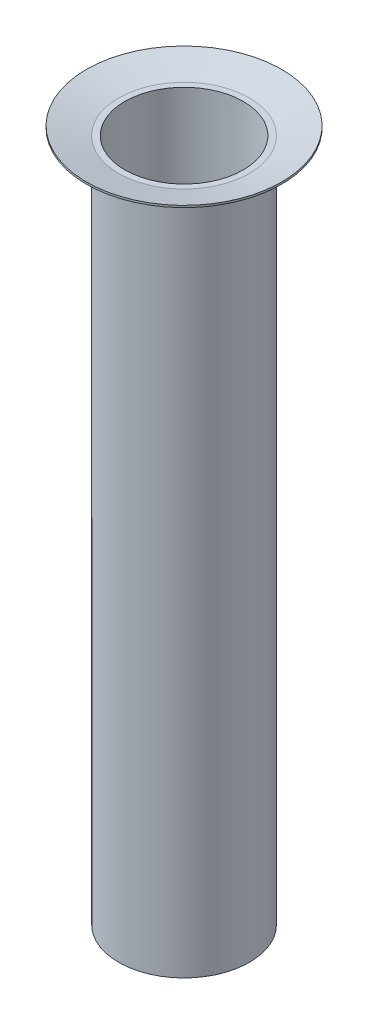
ISO-10303-21;
HEADER;
FILE_DESCRIPTION(('STEP AP214'),'2;1');
FILE_NAME('part.step','',(''),(''),'','','');
FILE_SCHEMA(('AUTOMOTIVE_DESIGN { 1 0 10303 214 1 1 1 1 }'));
ENDSEC;
DATA;
#1=APPLICATION_CONTEXT('core data for automotive mechanical design processes');
#2=APPLICATION_PROTOCOL_DEFINITION('international standard','automotive_design',2000,#1);
#3=PRODUCT_CONTEXT('',#1,'mechanical');
#4=PRODUCT('Part','Part','',(#3));
#5=PRODUCT_RELATED_PRODUCT_CATEGORY('part','',(#4));
#6=PRODUCT_DEFINITION_FORMATION('','',#4);
#7=PRODUCT_DEFINITION_CONTEXT('part definition',#1,'design');
#8=PRODUCT_DEFINITION('design','',#6,#7);
#9=PRODUCT_DEFINITION_SHAPE('','',#8);
#10=(LENGTH_UNIT() NAMED_UNIT(*) SI_UNIT(.MILLI.,.METRE.));
#11=(NAMED_UNIT(*) PLANE_ANGLE_UNIT() SI_UNIT($,.RADIAN.));
#12=(NAMED_UNIT(*) SI_UNIT($,.STERADIAN.) SOLID_ANGLE_UNIT());
#13=UNCERTAINTY_MEASURE_WITH_UNIT(LENGTH_MEASURE(1.E-05),#10,'distance_accuracy_value','');
#14=(GEOMETRIC_REPRESENTATION_CONTEXT(3) GLOBAL_UNCERTAINTY_ASSIGNED_CONTEXT((#13)) GLOBAL_UNIT_ASSIGNED_CONTEXT((#10,
#11,#12)) REPRESENTATION_CONTEXT('',''));
#15=CARTESIAN_POINT('',(0.,0.,0.));
#16=DIRECTION('',(0.,0.,1.));
#17=DIRECTION('',(1.,0.,0.));
#18=AXIS2_PLACEMENT_3D('',#15,#16,#17);
#19=CARTESIAN_POINT('',(8.50900000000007,88.9,0.));
#20=DIRECTION('',(0.,-1.,0.));
#21=DIRECTION('',(1.,0.,0.));
#22=AXIS2_PLACEMENT_3D('',#19,#20,#21);
#23=PLANE('',#22);
#24=CARTESIAN_POINT('',(0.,88.9,0.));
#25=DIRECTION('',(0.,1.,0.));
#26=DIRECTION('',(-1.,0.,0.));
#27=AXIS2_PLACEMENT_3D('',#24,#25,#26);
#28=CIRCLE('',#27,8.509);
#29=CARTESIAN_POINT('',(-8.50900000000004,88.9,0.));
#30=VERTEX_POINT('',#29);
#31=EDGE_CURVE('E48',#30,#30,#28,.T.);
#32=ORIENTED_EDGE('',*,*,#31,.T.);
#33=EDGE_LOOP('',(#32));
#34=FACE_BOUND('',#33,.T.);
#35=CARTESIAN_POINT('',(0.,88.9,0.));
#36=DIRECTION('',(0.,-1.,0.));
#37=DIRECTION('',(1.,0.,0.));
#38=AXIS2_PLACEMENT_3D('',#35,#36,#37);
#39=CIRCLE('',#38,7.71525);
#40=CARTESIAN_POINT('',(7.71524999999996,88.9,0.));
#41=VERTEX_POINT('',#40);
#42=EDGE_CURVE('E51',#41,#41,#39,.F.);
#43=ORIENTED_EDGE('',*,*,#42,.F.);
#44=EDGE_LOOP('',(#43));
#45=FACE_BOUND('',#44,.T.);
#46=ADVANCED_FACE('F28',(#34,#45),#23,.F.);
#47=CARTESIAN_POINT('',(0.,0.,0.));
#48=DIRECTION('',(0.,1.,0.));
#49=DIRECTION('',(-1.,0.,0.));
#50=AXIS2_PLACEMENT_3D('',#47,#48,#49);
#51=PLANE('',#50);
#52=CARTESIAN_POINT('',(0.,0.,0.));
#53=DIRECTION('',(0.,1.,0.));
#54=DIRECTION('',(-1.,0.,0.));
#55=AXIS2_PLACEMENT_3D('',#52,#53,#54);
#56=CIRCLE('',#55,8.509);
#57=CARTESIAN_POINT('',(-8.509,0.,0.));
#58=VERTEX_POINT('',#57);
#59=EDGE_CURVE('E10',#58,#58,#56,.T.);
#60=ORIENTED_EDGE('',*,*,#59,.F.);
#61=EDGE_LOOP('',(#60));
#62=FACE_BOUND('',#61,.T.);
#63=ADVANCED_FACE('F30',(#62),#51,.F.);
#64=CARTESIAN_POINT('',(0.,93.0279020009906,0.));
#65=DIRECTION('',(0.,1.,0.));
#66=DIRECTION('',(-1.,0.,0.));
#67=AXIS2_PLACEMENT_3D('',#64,#65,#66);
#68=CYLINDRICAL_SURFACE('',#67,8.509);
#69=CARTESIAN_POINT('',(-1.17961196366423E-13,88.646,0.));
#70=DIRECTION('',(0.,1.,0.));
#71=DIRECTION('',(-1.,0.,0.));
#72=AXIS2_PLACEMENT_3D('',#69,#70,#71);
#73=CIRCLE('',#72,8.509);
#74=CARTESIAN_POINT('',(-8.50900000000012,88.646,0.));
#75=VERTEX_POINT('',#74);
#76=EDGE_CURVE('E35',#75,#75,#73,.T.);
#77=ORIENTED_EDGE('',*,*,#76,.F.);
#78=EDGE_LOOP('',(#77));
#79=FACE_BOUND('',#78,.T.);
#80=ORIENTED_EDGE('',*,*,#59,.T.);
#81=EDGE_LOOP('',(#80));
#82=FACE_BOUND('',#81,.T.);
#83=ADVANCED_FACE('F75',(#79,#82),#68,.T.);
#84=CARTESIAN_POINT('',(-1.17961196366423E-13,88.646,0.));
#85=DIRECTION('',(0.,1.,0.));
#86=DIRECTION('',(-1.,0.,0.));
#87=AXIS2_PLACEMENT_3D('',#84,#85,#86);
#88=CONICAL_SURFACE('',#87,8.509,1.30899693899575);
#89=CARTESIAN_POINT('',(0.,89.7689750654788,0.));
#90=DIRECTION('',(0.,1.,0.));
#91=DIRECTION('',(-1.,0.,0.));
#92=AXIS2_PLACEMENT_3D('',#89,#90,#91);
#93=CIRCLE('',#92,12.7);
#94=CARTESIAN_POINT('',(-12.7000000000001,89.7689750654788,0.));
#95=VERTEX_POINT('',#94);
#96=EDGE_CURVE('E39',#95,#95,#93,.T.);
#97=ORIENTED_EDGE('',*,*,#96,.F.);
#98=EDGE_LOOP('',(#97));
#99=FACE_BOUND('',#98,.T.);
#100=ORIENTED_EDGE('',*,*,#76,.T.);
#101=EDGE_LOOP('',(#100));
#102=FACE_BOUND('',#101,.T.);
#103=ADVANCED_FACE('F85',(#99,#102),#88,.T.);
#104=CARTESIAN_POINT('',(0.,93.0279020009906,0.));
#105=DIRECTION('',(0.,1.,0.));
#106=DIRECTION('',(-1.,0.,0.));
#107=AXIS2_PLACEMENT_3D('',#104,#105,#106);
#108=CYLINDRICAL_SURFACE('',#107,12.7);
#109=CARTESIAN_POINT('',(0.,90.0229750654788,0.));
#110=DIRECTION('',(0.,1.,0.));
#111=DIRECTION('',(-1.,0.,0.));
#112=AXIS2_PLACEMENT_3D('',#109,#110,#111);
#113=CIRCLE('',#112,12.7);
#114=CARTESIAN_POINT('',(-12.7,90.0229750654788,0.));
#115=VERTEX_POINT('',#114);
#116=EDGE_CURVE('E43',#115,#115,#113,.T.);
#117=ORIENTED_EDGE('',*,*,#116,.F.);
#118=EDGE_LOOP('',(#117));
#119=FACE_BOUND('',#118,.T.);
#120=ORIENTED_EDGE('',*,*,#96,.T.);
#121=EDGE_LOOP('',(#120));
#122=FACE_BOUND('',#121,.T.);
#123=ADVANCED_FACE('F81',(#119,#122),#108,.T.);
#124=CARTESIAN_POINT('',(0.,90.0229750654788,0.));
#125=DIRECTION('',(0.,1.,0.));
#126=DIRECTION('',(-1.,0.,0.));
#127=AXIS2_PLACEMENT_3D('',#124,#125,#126);
#128=CONICAL_SURFACE('',#127,12.7,1.30899693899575);
#129=ORIENTED_EDGE('',*,*,#31,.F.);
#130=EDGE_LOOP('',(#129));
#131=FACE_BOUND('',#130,.T.);
#132=ORIENTED_EDGE('',*,*,#116,.T.);
#133=EDGE_LOOP('',(#132));
#134=FACE_BOUND('',#133,.T.);
#135=ADVANCED_FACE('F67',(#131,#134),#128,.F.);
#136=CARTESIAN_POINT('',(0.,0.793749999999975,0.));
#137=DIRECTION('',(0.,1.,0.));
#138=DIRECTION('',(-1.,0.,0.));
#139=AXIS2_PLACEMENT_3D('',#136,#137,#138);
#140=PLANE('',#139);
#141=CARTESIAN_POINT('',(0.,0.793749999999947,0.));
#142=DIRECTION('',(0.,1.,0.));
#143=DIRECTION('',(-1.,0.,0.));
#144=AXIS2_PLACEMENT_3D('',#141,#142,#143);
#145=CIRCLE('',#144,7.71525);
#146=CARTESIAN_POINT('',(-7.71525,0.793749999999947,0.));
#147=VERTEX_POINT('',#146);
#148=EDGE_CURVE('E54',#147,#147,#145,.T.);
#149=ORIENTED_EDGE('',*,*,#148,.T.);
#150=EDGE_LOOP('',(#149));
#151=FACE_BOUND('',#150,.T.);
#152=ADVANCED_FACE('F58',(#151),#140,.T.);
#153=CARTESIAN_POINT('',(0.,93.0279020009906,0.));
#154=DIRECTION('',(0.,1.,0.));
#155=DIRECTION('',(-1.,0.,0.));
#156=AXIS2_PLACEMENT_3D('',#153,#154,#155);
#157=CYLINDRICAL_SURFACE('',#156,7.71525);
#158=ORIENTED_EDGE('',*,*,#42,.T.);
#159=EDGE_LOOP('',(#158));
#160=FACE_BOUND('',#159,.T.);
#161=ORIENTED_EDGE('',*,*,#148,.F.);
#162=EDGE_LOOP('',(#161));
#163=FACE_BOUND('',#162,.T.);
#164=ADVANCED_FACE('F60',(#160,#163),#157,.F.);
#165=CLOSED_SHELL('',(#46,#63,#83,#103,#123,#135,#152,#164));
#166=MANIFOLD_SOLID_BREP('B2',#165);
#167=ADVANCED_BREP_SHAPE_REPRESENTATION('',(#18,#166),#14);
#168=SHAPE_DEFINITION_REPRESENTATION(#9,#167);
ENDSEC;
END-ISO-10303-21;
